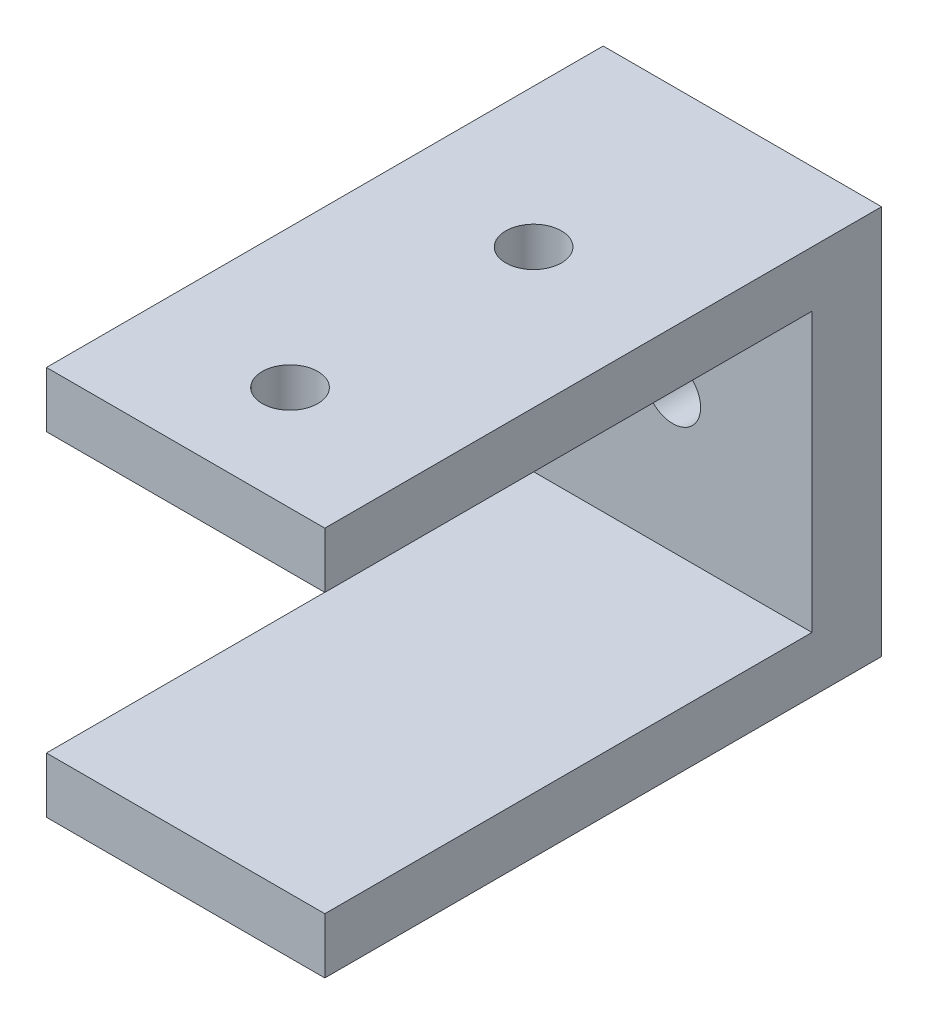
ISO-10303-21;
HEADER;
FILE_DESCRIPTION(('STEP AP214'),'2;1');
FILE_NAME('part.step','',(''),(''),'','','');
FILE_SCHEMA(('AUTOMOTIVE_DESIGN { 1 0 10303 214 1 1 1 1 }'));
ENDSEC;
DATA;
#1=APPLICATION_CONTEXT('core data for automotive mechanical design processes');
#2=APPLICATION_PROTOCOL_DEFINITION('international standard','automotive_design',2000,#1);
#3=PRODUCT_CONTEXT('',#1,'mechanical');
#4=PRODUCT('Part','Part','',(#3));
#5=PRODUCT_RELATED_PRODUCT_CATEGORY('part','',(#4));
#6=PRODUCT_DEFINITION_FORMATION('','',#4);
#7=PRODUCT_DEFINITION_CONTEXT('part definition',#1,'design');
#8=PRODUCT_DEFINITION('design','',#6,#7);
#9=PRODUCT_DEFINITION_SHAPE('','',#8);
#10=(LENGTH_UNIT() NAMED_UNIT(*) SI_UNIT(.MILLI.,.METRE.));
#11=(NAMED_UNIT(*) PLANE_ANGLE_UNIT() SI_UNIT($,.RADIAN.));
#12=(NAMED_UNIT(*) SI_UNIT($,.STERADIAN.) SOLID_ANGLE_UNIT());
#13=UNCERTAINTY_MEASURE_WITH_UNIT(LENGTH_MEASURE(1.E-05),#10,'distance_accuracy_value','');
#14=(GEOMETRIC_REPRESENTATION_CONTEXT(3) GLOBAL_UNCERTAINTY_ASSIGNED_CONTEXT((#13)) GLOBAL_UNIT_ASSIGNED_CONTEXT((#10,
#11,#12)) REPRESENTATION_CONTEXT('',''));
#15=CARTESIAN_POINT('',(0.,0.,0.));
#16=DIRECTION('',(0.,0.,1.));
#17=DIRECTION('',(1.,0.,0.));
#18=AXIS2_PLACEMENT_3D('',#15,#16,#17);
#19=CARTESIAN_POINT('',(20.,23.99,39.9999999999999));
#20=DIRECTION('',(0.,0.,-1.));
#21=DIRECTION('',(-1.,0.,0.));
#22=AXIS2_PLACEMENT_3D('',#19,#20,#21);
#23=PLANE('',#22);
#24=DIRECTION('',(0.,-1.,0.));
#25=VECTOR('',#24,1.);
#26=CARTESIAN_POINT('',(0.,23.99,39.9999999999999));
#27=LINE('',#26,#25);
#28=CARTESIAN_POINT('',(0.,23.99,39.9999999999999));
#29=VERTEX_POINT('',#28);
#30=CARTESIAN_POINT('',(0.,19.99,39.9999999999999));
#31=VERTEX_POINT('',#30);
#32=EDGE_CURVE('E147',#29,#31,#27,.T.);
#33=ORIENTED_EDGE('',*,*,#32,.T.);
#34=DIRECTION('',(-1.,0.,0.));
#35=VECTOR('',#34,1.);
#36=CARTESIAN_POINT('',(20.,19.99,39.9999999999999));
#37=LINE('',#36,#35);
#38=CARTESIAN_POINT('',(20.,19.99,39.9999999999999));
#39=VERTEX_POINT('',#38);
#40=EDGE_CURVE('E53',#39,#31,#37,.T.);
#41=ORIENTED_EDGE('',*,*,#40,.F.);
#42=DIRECTION('',(0.,-1.,0.));
#43=VECTOR('',#42,1.);
#44=CARTESIAN_POINT('',(20.,23.99,39.9999999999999));
#45=LINE('',#44,#43);
#46=CARTESIAN_POINT('',(20.,23.99,39.9999999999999));
#47=VERTEX_POINT('',#46);
#48=EDGE_CURVE('E102',#47,#39,#45,.T.);
#49=ORIENTED_EDGE('',*,*,#48,.F.);
#50=DIRECTION('',(-1.,0.,0.));
#51=VECTOR('',#50,1.);
#52=CARTESIAN_POINT('',(20.,23.99,39.9999999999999));
#53=LINE('',#52,#51);
#54=EDGE_CURVE('E11',#47,#29,#53,.T.);
#55=ORIENTED_EDGE('',*,*,#54,.T.);
#56=EDGE_LOOP('',(#33,#41,#49,#55));
#57=FACE_BOUND('',#56,.T.);
#58=ADVANCED_FACE('F44',(#57),#23,.F.);
#59=CARTESIAN_POINT('',(20.,19.99,24.9999999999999));
#60=DIRECTION('',(0.,1.,0.));
#61=DIRECTION('',(0.,0.,1.));
#62=AXIS2_PLACEMENT_3D('',#59,#60,#61);
#63=PLANE('',#62);
#64=CARTESIAN_POINT('',(10.,19.99,14.9999999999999));
#65=DIRECTION('',(0.,1.,0.));
#66=DIRECTION('',(0.,0.,1.));
#67=AXIS2_PLACEMENT_3D('',#64,#65,#66);
#68=CIRCLE('',#67,2.);
#69=CARTESIAN_POINT('',(10.,19.99,16.9999999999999));
#70=VERTEX_POINT('',#69);
#71=EDGE_CURVE('E224',#70,#70,#68,.T.);
#72=ORIENTED_EDGE('',*,*,#71,.T.);
#73=EDGE_LOOP('',(#72));
#74=FACE_BOUND('',#73,.T.);
#75=CARTESIAN_POINT('',(10.,19.99,32.4999999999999));
#76=DIRECTION('',(0.,1.,0.));
#77=DIRECTION('',(0.,0.,1.));
#78=AXIS2_PLACEMENT_3D('',#75,#76,#77);
#79=CIRCLE('',#78,2.);
#80=CARTESIAN_POINT('',(10.,19.99,34.4999999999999));
#81=VERTEX_POINT('',#80);
#82=EDGE_CURVE('E227',#81,#81,#79,.T.);
#83=ORIENTED_EDGE('',*,*,#82,.T.);
#84=EDGE_LOOP('',(#83));
#85=FACE_BOUND('',#84,.T.);
#86=DIRECTION('',(0.,0.,-1.));
#87=VECTOR('',#86,1.);
#88=CARTESIAN_POINT('',(0.,19.99,24.9999999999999));
#89=LINE('',#88,#87);
#90=CARTESIAN_POINT('',(0.,19.99,4.9999999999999));
#91=VERTEX_POINT('',#90);
#92=EDGE_CURVE('E154',#31,#91,#89,.T.);
#93=ORIENTED_EDGE('',*,*,#92,.T.);
#94=DIRECTION('',(-1.,0.,0.));
#95=VECTOR('',#94,1.);
#96=CARTESIAN_POINT('',(20.,19.99,4.9999999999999));
#97=LINE('',#96,#95);
#98=CARTESIAN_POINT('',(20.,19.99,4.9999999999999));
#99=VERTEX_POINT('',#98);
#100=EDGE_CURVE('E183',#99,#91,#97,.T.);
#101=ORIENTED_EDGE('',*,*,#100,.F.);
#102=DIRECTION('',(0.,0.,-1.));
#103=VECTOR('',#102,1.);
#104=CARTESIAN_POINT('',(20.,19.99,39.9999999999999));
#105=LINE('',#104,#103);
#106=EDGE_CURVE('E195',#39,#99,#105,.T.);
#107=ORIENTED_EDGE('',*,*,#106,.F.);
#108=ORIENTED_EDGE('',*,*,#40,.T.);
#109=EDGE_LOOP('',(#93,#101,#107,#108));
#110=FACE_BOUND('',#109,.T.);
#111=ADVANCED_FACE('F194',(#74,#85,#110),#63,.F.);
#112=CARTESIAN_POINT('',(20.,19.99,4.9999999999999));
#113=DIRECTION('',(0.,0.,-1.));
#114=DIRECTION('',(-1.,0.,0.));
#115=AXIS2_PLACEMENT_3D('',#112,#113,#114);
#116=PLANE('',#115);
#117=CARTESIAN_POINT('',(10.,9.99499999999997,4.9999999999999));
#118=DIRECTION('',(0.,0.,-1.));
#119=DIRECTION('',(-1.,0.,0.));
#120=AXIS2_PLACEMENT_3D('',#117,#118,#119);
#121=CIRCLE('',#120,2.);
#122=CARTESIAN_POINT('',(8.,9.99499999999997,4.9999999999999));
#123=VERTEX_POINT('',#122);
#124=EDGE_CURVE('E152',#123,#123,#121,.T.);
#125=ORIENTED_EDGE('',*,*,#124,.T.);
#126=EDGE_LOOP('',(#125));
#127=FACE_BOUND('',#126,.T.);
#128=DIRECTION('',(0.,-1.,0.));
#129=VECTOR('',#128,1.);
#130=CARTESIAN_POINT('',(0.,19.99,4.9999999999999));
#131=LINE('',#130,#129);
#132=CARTESIAN_POINT('',(0.,0.,4.9999999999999));
#133=VERTEX_POINT('',#132);
#134=EDGE_CURVE('E159',#91,#133,#131,.T.);
#135=ORIENTED_EDGE('',*,*,#134,.T.);
#136=DIRECTION('',(-1.,0.,0.));
#137=VECTOR('',#136,1.);
#138=CARTESIAN_POINT('',(20.,0.,4.9999999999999));
#139=LINE('',#138,#137);
#140=CARTESIAN_POINT('',(20.,0.,4.9999999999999));
#141=VERTEX_POINT('',#140);
#142=EDGE_CURVE('E179',#141,#133,#139,.T.);
#143=ORIENTED_EDGE('',*,*,#142,.F.);
#144=DIRECTION('',(0.,-1.,0.));
#145=VECTOR('',#144,1.);
#146=CARTESIAN_POINT('',(20.,19.99,4.9999999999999));
#147=LINE('',#146,#145);
#148=EDGE_CURVE('E207',#99,#141,#147,.T.);
#149=ORIENTED_EDGE('',*,*,#148,.F.);
#150=ORIENTED_EDGE('',*,*,#100,.T.);
#151=EDGE_LOOP('',(#135,#143,#149,#150));
#152=FACE_BOUND('',#151,.T.);
#153=ADVANCED_FACE('F202',(#127,#152),#116,.F.);
#154=CARTESIAN_POINT('',(20.,0.,39.9999999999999));
#155=DIRECTION('',(0.,-1.,0.));
#156=DIRECTION('',(0.,0.,-1.));
#157=AXIS2_PLACEMENT_3D('',#154,#155,#156);
#158=PLANE('',#157);
#159=DIRECTION('',(0.,0.,1.));
#160=VECTOR('',#159,1.);
#161=CARTESIAN_POINT('',(0.,0.,39.9999999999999));
#162=LINE('',#161,#160);
#163=CARTESIAN_POINT('',(0.,0.,39.9999999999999));
#164=VERTEX_POINT('',#163);
#165=EDGE_CURVE('E162',#133,#164,#162,.T.);
#166=ORIENTED_EDGE('',*,*,#165,.T.);
#167=DIRECTION('',(-1.,0.,0.));
#168=VECTOR('',#167,1.);
#169=CARTESIAN_POINT('',(20.,0.,39.9999999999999));
#170=LINE('',#169,#168);
#171=CARTESIAN_POINT('',(20.,0.,39.9999999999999));
#172=VERTEX_POINT('',#171);
#173=EDGE_CURVE('E140',#172,#164,#170,.T.);
#174=ORIENTED_EDGE('',*,*,#173,.F.);
#175=DIRECTION('',(0.,0.,1.));
#176=VECTOR('',#175,1.);
#177=CARTESIAN_POINT('',(20.,0.,4.9999999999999));
#178=LINE('',#177,#176);
#179=EDGE_CURVE('E123',#141,#172,#178,.T.);
#180=ORIENTED_EDGE('',*,*,#179,.F.);
#181=ORIENTED_EDGE('',*,*,#142,.T.);
#182=EDGE_LOOP('',(#166,#174,#180,#181));
#183=FACE_BOUND('',#182,.T.);
#184=ADVANCED_FACE('F201',(#183),#158,.F.);
#185=CARTESIAN_POINT('',(20.,-4.00000000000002,39.9999999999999));
#186=DIRECTION('',(0.,0.,-1.));
#187=DIRECTION('',(-1.,0.,0.));
#188=AXIS2_PLACEMENT_3D('',#185,#186,#187);
#189=PLANE('',#188);
#190=DIRECTION('',(0.,-1.,0.));
#191=VECTOR('',#190,1.);
#192=CARTESIAN_POINT('',(0.,-4.00000000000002,39.9999999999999));
#193=LINE('',#192,#191);
#194=CARTESIAN_POINT('',(0.,-4.00000000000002,39.9999999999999));
#195=VERTEX_POINT('',#194);
#196=EDGE_CURVE('E132',#164,#195,#193,.T.);
#197=ORIENTED_EDGE('',*,*,#196,.T.);
#198=DIRECTION('',(-1.,0.,0.));
#199=VECTOR('',#198,1.);
#200=CARTESIAN_POINT('',(20.,-4.00000000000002,39.9999999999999));
#201=LINE('',#200,#199);
#202=CARTESIAN_POINT('',(20.,-4.00000000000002,39.9999999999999));
#203=VERTEX_POINT('',#202);
#204=EDGE_CURVE('E135',#203,#195,#201,.T.);
#205=ORIENTED_EDGE('',*,*,#204,.F.);
#206=DIRECTION('',(0.,-1.,0.));
#207=VECTOR('',#206,1.);
#208=CARTESIAN_POINT('',(20.,-4.00000000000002,39.9999999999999));
#209=LINE('',#208,#207);
#210=EDGE_CURVE('E118',#172,#203,#209,.T.);
#211=ORIENTED_EDGE('',*,*,#210,.F.);
#212=ORIENTED_EDGE('',*,*,#173,.T.);
#213=EDGE_LOOP('',(#197,#205,#211,#212));
#214=FACE_BOUND('',#213,.T.);
#215=ADVANCED_FACE('F131',(#214),#189,.F.);
#216=CARTESIAN_POINT('',(20.,-4.00000000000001,24.9999999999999));
#217=DIRECTION('',(0.,1.,0.));
#218=DIRECTION('',(0.,0.,1.));
#219=AXIS2_PLACEMENT_3D('',#216,#217,#218);
#220=PLANE('',#219);
#221=DIRECTION('',(0.,0.,-1.));
#222=VECTOR('',#221,1.);
#223=CARTESIAN_POINT('',(0.,-4.00000000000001,24.9999999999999));
#224=LINE('',#223,#222);
#225=CARTESIAN_POINT('',(0.,-4.00000000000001,-1.00613961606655E-13));
#226=VERTEX_POINT('',#225);
#227=EDGE_CURVE('E92',#195,#226,#224,.T.);
#228=ORIENTED_EDGE('',*,*,#227,.T.);
#229=DIRECTION('',(-1.,0.,0.));
#230=VECTOR('',#229,1.);
#231=CARTESIAN_POINT('',(20.,-4.00000000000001,-1.00613961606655E-13));
#232=LINE('',#231,#230);
#233=CARTESIAN_POINT('',(20.,-4.00000000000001,-1.00613961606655E-13));
#234=VERTEX_POINT('',#233);
#235=EDGE_CURVE('E139',#234,#226,#232,.T.);
#236=ORIENTED_EDGE('',*,*,#235,.F.);
#237=DIRECTION('',(0.,0.,-1.));
#238=VECTOR('',#237,1.);
#239=CARTESIAN_POINT('',(20.,-4.00000000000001,24.9999999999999));
#240=LINE('',#239,#238);
#241=EDGE_CURVE('E124',#203,#234,#240,.T.);
#242=ORIENTED_EDGE('',*,*,#241,.F.);
#243=ORIENTED_EDGE('',*,*,#204,.T.);
#244=EDGE_LOOP('',(#228,#236,#242,#243));
#245=FACE_BOUND('',#244,.T.);
#246=ADVANCED_FACE('F138',(#245),#220,.F.);
#247=CARTESIAN_POINT('',(20.,-4.00000000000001,-1.00613961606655E-13));
#248=DIRECTION('',(0.,0.,1.));
#249=DIRECTION('',(0.,-1.,0.));
#250=AXIS2_PLACEMENT_3D('',#247,#248,#249);
#251=PLANE('',#250);
#252=CARTESIAN_POINT('',(10.,9.99499999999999,0.));
#253=DIRECTION('',(0.,0.,-1.));
#254=DIRECTION('',(0.,1.,0.));
#255=AXIS2_PLACEMENT_3D('',#252,#253,#254);
#256=CIRCLE('',#255,2.);
#257=CARTESIAN_POINT('',(10.,11.995,0.));
#258=VERTEX_POINT('',#257);
#259=EDGE_CURVE('E219',#258,#258,#256,.T.);
#260=ORIENTED_EDGE('',*,*,#259,.F.);
#261=EDGE_LOOP('',(#260));
#262=FACE_BOUND('',#261,.T.);
#263=DIRECTION('',(0.,1.,0.));
#264=VECTOR('',#263,1.);
#265=CARTESIAN_POINT('',(0.,-4.00000000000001,-1.00613961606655E-13));
#266=LINE('',#265,#264);
#267=CARTESIAN_POINT('',(0.,23.99,0.));
#268=VERTEX_POINT('',#267);
#269=EDGE_CURVE('E96',#226,#268,#266,.T.);
#270=ORIENTED_EDGE('',*,*,#269,.T.);
#271=DIRECTION('',(-1.,0.,0.));
#272=VECTOR('',#271,1.);
#273=CARTESIAN_POINT('',(20.,23.99,0.));
#274=LINE('',#273,#272);
#275=CARTESIAN_POINT('',(20.,23.99,0.));
#276=VERTEX_POINT('',#275);
#277=EDGE_CURVE('E149',#276,#268,#274,.T.);
#278=ORIENTED_EDGE('',*,*,#277,.F.);
#279=DIRECTION('',(0.,1.,0.));
#280=VECTOR('',#279,1.);
#281=CARTESIAN_POINT('',(20.,-4.00000000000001,-1.00613961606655E-13));
#282=LINE('',#281,#280);
#283=EDGE_CURVE('E141',#234,#276,#282,.T.);
#284=ORIENTED_EDGE('',*,*,#283,.F.);
#285=ORIENTED_EDGE('',*,*,#235,.T.);
#286=EDGE_LOOP('',(#270,#278,#284,#285));
#287=FACE_BOUND('',#286,.T.);
#288=ADVANCED_FACE('F246',(#262,#287),#251,.F.);
#289=CARTESIAN_POINT('',(20.,23.99,0.));
#290=DIRECTION('',(0.,-1.,0.));
#291=DIRECTION('',(0.,0.,-1.));
#292=AXIS2_PLACEMENT_3D('',#289,#290,#291);
#293=PLANE('',#292);
#294=CARTESIAN_POINT('',(10.,23.99,14.9999999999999));
#295=DIRECTION('',(0.,1.,0.));
#296=DIRECTION('',(0.,0.,1.));
#297=AXIS2_PLACEMENT_3D('',#294,#295,#296);
#298=CIRCLE('',#297,2.);
#299=CARTESIAN_POINT('',(10.,23.99,16.9999999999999));
#300=VERTEX_POINT('',#299);
#301=EDGE_CURVE('E233',#300,#300,#298,.T.);
#302=ORIENTED_EDGE('',*,*,#301,.F.);
#303=EDGE_LOOP('',(#302));
#304=FACE_BOUND('',#303,.T.);
#305=CARTESIAN_POINT('',(10.,23.99,32.4999999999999));
#306=DIRECTION('',(0.,1.,0.));
#307=DIRECTION('',(0.,0.,1.));
#308=AXIS2_PLACEMENT_3D('',#305,#306,#307);
#309=CIRCLE('',#308,2.);
#310=CARTESIAN_POINT('',(10.,23.99,34.4999999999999));
#311=VERTEX_POINT('',#310);
#312=EDGE_CURVE('E235',#311,#311,#309,.T.);
#313=ORIENTED_EDGE('',*,*,#312,.F.);
#314=EDGE_LOOP('',(#313));
#315=FACE_BOUND('',#314,.T.);
#316=DIRECTION('',(0.,0.,1.));
#317=VECTOR('',#316,1.);
#318=CARTESIAN_POINT('',(0.,23.99,0.));
#319=LINE('',#318,#317);
#320=EDGE_CURVE('E171',#268,#29,#319,.T.);
#321=ORIENTED_EDGE('',*,*,#320,.T.);
#322=ORIENTED_EDGE('',*,*,#54,.F.);
#323=DIRECTION('',(0.,0.,1.));
#324=VECTOR('',#323,1.);
#325=CARTESIAN_POINT('',(20.,23.99,24.9999999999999));
#326=LINE('',#325,#324);
#327=EDGE_CURVE('E61',#276,#47,#326,.T.);
#328=ORIENTED_EDGE('',*,*,#327,.F.);
#329=ORIENTED_EDGE('',*,*,#277,.T.);
#330=EDGE_LOOP('',(#321,#322,#328,#329));
#331=FACE_BOUND('',#330,.T.);
#332=ADVANCED_FACE('F243',(#304,#315,#331),#293,.F.);
#333=CARTESIAN_POINT('',(20.,0.,0.));
#334=DIRECTION('',(1.,0.,0.));
#335=DIRECTION('',(0.,0.,-1.));
#336=AXIS2_PLACEMENT_3D('',#333,#334,#335);
#337=PLANE('',#336);
#338=ORIENTED_EDGE('',*,*,#327,.T.);
#339=ORIENTED_EDGE('',*,*,#48,.T.);
#340=ORIENTED_EDGE('',*,*,#106,.T.);
#341=ORIENTED_EDGE('',*,*,#148,.T.);
#342=ORIENTED_EDGE('',*,*,#179,.T.);
#343=ORIENTED_EDGE('',*,*,#210,.T.);
#344=ORIENTED_EDGE('',*,*,#241,.T.);
#345=ORIENTED_EDGE('',*,*,#283,.T.);
#346=EDGE_LOOP('',(#338,#339,#340,#341,#342,#343,#344,#345));
#347=FACE_BOUND('',#346,.T.);
#348=ADVANCED_FACE('F122',(#347),#337,.T.);
#349=CARTESIAN_POINT('',(0.,0.,0.));
#350=DIRECTION('',(1.,0.,0.));
#351=DIRECTION('',(0.,0.,-1.));
#352=AXIS2_PLACEMENT_3D('',#349,#350,#351);
#353=PLANE('',#352);
#354=ORIENTED_EDGE('',*,*,#32,.F.);
#355=ORIENTED_EDGE('',*,*,#320,.F.);
#356=ORIENTED_EDGE('',*,*,#269,.F.);
#357=ORIENTED_EDGE('',*,*,#227,.F.);
#358=ORIENTED_EDGE('',*,*,#196,.F.);
#359=ORIENTED_EDGE('',*,*,#165,.F.);
#360=ORIENTED_EDGE('',*,*,#134,.F.);
#361=ORIENTED_EDGE('',*,*,#92,.F.);
#362=EDGE_LOOP('',(#354,#355,#356,#357,#358,#359,#360,#361));
#363=FACE_BOUND('',#362,.T.);
#364=ADVANCED_FACE('F200',(#363),#353,.F.);
#365=CARTESIAN_POINT('',(10.,9.99499999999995,10.));
#366=DIRECTION('',(0.,0.,-1.));
#367=DIRECTION('',(0.,1.,0.));
#368=AXIS2_PLACEMENT_3D('',#365,#366,#367);
#369=CYLINDRICAL_SURFACE('',#368,2.);
#370=ORIENTED_EDGE('',*,*,#259,.T.);
#371=EDGE_LOOP('',(#370));
#372=FACE_BOUND('',#371,.T.);
#373=ORIENTED_EDGE('',*,*,#124,.F.);
#374=EDGE_LOOP('',(#373));
#375=FACE_BOUND('',#374,.T.);
#376=ADVANCED_FACE('F298',(#372,#375),#369,.F.);
#377=CARTESIAN_POINT('',(10.,13.99,32.4999999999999));
#378=DIRECTION('',(0.,1.,0.));
#379=DIRECTION('',(0.,0.,1.));
#380=AXIS2_PLACEMENT_3D('',#377,#378,#379);
#381=CYLINDRICAL_SURFACE('',#380,2.);
#382=ORIENTED_EDGE('',*,*,#312,.T.);
#383=EDGE_LOOP('',(#382));
#384=FACE_BOUND('',#383,.T.);
#385=ORIENTED_EDGE('',*,*,#82,.F.);
#386=EDGE_LOOP('',(#385));
#387=FACE_BOUND('',#386,.T.);
#388=ADVANCED_FACE('F336',(#384,#387),#381,.F.);
#389=CARTESIAN_POINT('',(10.,13.99,14.9999999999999));
#390=DIRECTION('',(0.,1.,0.));
#391=DIRECTION('',(0.,0.,1.));
#392=AXIS2_PLACEMENT_3D('',#389,#390,#391);
#393=CYLINDRICAL_SURFACE('',#392,2.);
#394=ORIENTED_EDGE('',*,*,#301,.T.);
#395=EDGE_LOOP('',(#394));
#396=FACE_BOUND('',#395,.T.);
#397=ORIENTED_EDGE('',*,*,#71,.F.);
#398=EDGE_LOOP('',(#397));
#399=FACE_BOUND('',#398,.T.);
#400=ADVANCED_FACE('F239',(#396,#399),#393,.F.);
#401=CLOSED_SHELL('',(#58,#111,#153,#184,#215,#246,#288,#332,#348,#364,#376,#388,#400));
#402=MANIFOLD_SOLID_BREP('B2',#401);
#403=ADVANCED_BREP_SHAPE_REPRESENTATION('',(#18,#402),#14);
#404=SHAPE_DEFINITION_REPRESENTATION(#9,#403);
ENDSEC;
END-ISO-10303-21;
